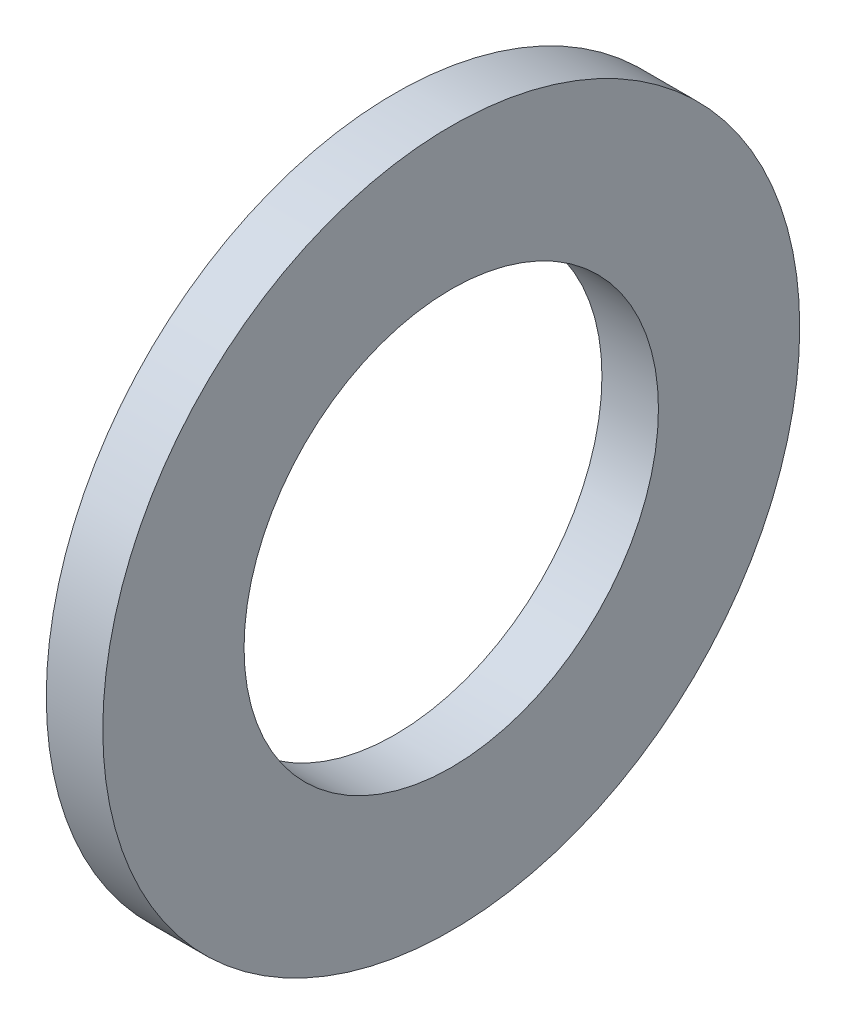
from build123d import *

# Parameters (mm, degrees)
SKETCH1_W = 3
SKETCH1_H = 7.5


with BuildPart() as part:
    # Sketch1 → Base-Revolve (revolve)
    with BuildSketch(Plane.XY, mode=Mode.PRIVATE) as base_revolve_sk:
        with Locations((-1.5, 14.75)):
            Rectangle(SKETCH1_W, SKETCH1_H)
    revolve(base_revolve_sk.sketch.rotate(Axis((-34.925, 0, 0), (1, 0, 0)), 90), axis=Axis((-34.925, 0, 0), (1, 0, 0)))


solid = part.part
